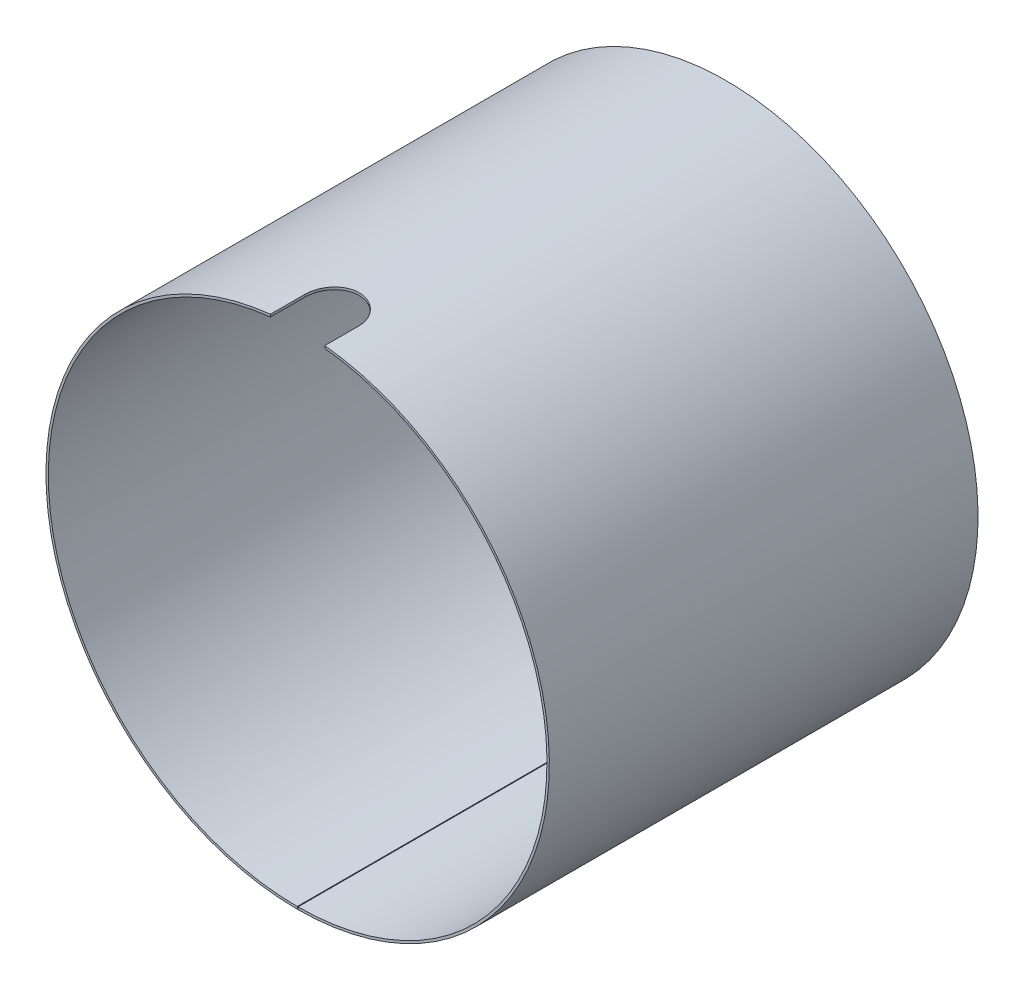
ISO-10303-21;
HEADER;
FILE_DESCRIPTION(('STEP AP214'),'2;1');
FILE_NAME('part.step','',(''),(''),'','','');
FILE_SCHEMA(('AUTOMOTIVE_DESIGN { 1 0 10303 214 1 1 1 1 }'));
ENDSEC;
DATA;
#1=APPLICATION_CONTEXT('core data for automotive mechanical design processes');
#2=APPLICATION_PROTOCOL_DEFINITION('international standard','automotive_design',2000,#1);
#3=PRODUCT_CONTEXT('',#1,'mechanical');
#4=PRODUCT('Part','Part','',(#3));
#5=PRODUCT_RELATED_PRODUCT_CATEGORY('part','',(#4));
#6=PRODUCT_DEFINITION_FORMATION('','',#4);
#7=PRODUCT_DEFINITION_CONTEXT('part definition',#1,'design');
#8=PRODUCT_DEFINITION('design','',#6,#7);
#9=PRODUCT_DEFINITION_SHAPE('','',#8);
#10=(LENGTH_UNIT() NAMED_UNIT(*) SI_UNIT(.MILLI.,.METRE.));
#11=(NAMED_UNIT(*) PLANE_ANGLE_UNIT() SI_UNIT($,.RADIAN.));
#12=(NAMED_UNIT(*) SI_UNIT($,.STERADIAN.) SOLID_ANGLE_UNIT());
#13=UNCERTAINTY_MEASURE_WITH_UNIT(LENGTH_MEASURE(1.E-05),#10,'distance_accuracy_value','');
#14=(GEOMETRIC_REPRESENTATION_CONTEXT(3) GLOBAL_UNCERTAINTY_ASSIGNED_CONTEXT((#13)) GLOBAL_UNIT_ASSIGNED_CONTEXT((#10,
#11,#12)) REPRESENTATION_CONTEXT('',''));
#15=CARTESIAN_POINT('',(0.,0.,0.));
#16=DIRECTION('',(0.,0.,1.));
#17=DIRECTION('',(1.,0.,0.));
#18=AXIS2_PLACEMENT_3D('',#15,#16,#17);
#19=CARTESIAN_POINT('',(0.,0.,6.99999997));
#20=DIRECTION('',(0.,0.,1.));
#21=DIRECTION('',(1.,0.,0.));
#22=AXIS2_PLACEMENT_3D('',#19,#20,#21);
#23=CYLINDRICAL_SURFACE('',#22,166.7748);
#24=DIRECTION('',(0.,0.,1.));
#25=VECTOR('',#24,1.);
#26=CARTESIAN_POINT('',(0.253999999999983,-166.77460657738,6.99999997));
#27=LINE('',#26,#25);
#28=CARTESIAN_POINT('',(0.253999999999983,-166.77460657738,484.425800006));
#29=VERTEX_POINT('',#28);
#30=CARTESIAN_POINT('',(0.253999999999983,-166.77460657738,200.37019997));
#31=VERTEX_POINT('',#30);
#32=EDGE_CURVE('E126',#29,#31,#27,.F.);
#33=ORIENTED_EDGE('',*,*,#32,.T.);
#34=CARTESIAN_POINT('',(0.,0.,200.37019997));
#35=DIRECTION('',(0.,0.,-1.));
#36=DIRECTION('',(-1.,0.,0.));
#37=AXIS2_PLACEMENT_3D('',#34,#35,#36);
#38=CIRCLE('',#37,166.7748);
#39=CARTESIAN_POINT('',(-0.254000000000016,-166.77460657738,200.37019997));
#40=VERTEX_POINT('',#39);
#41=EDGE_CURVE('E57',#31,#40,#38,.F.);
#42=ORIENTED_EDGE('',*,*,#41,.T.);
#43=DIRECTION('',(0.,0.,1.));
#44=VECTOR('',#43,1.);
#45=CARTESIAN_POINT('',(-0.254000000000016,-166.77460657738,6.99999997));
#46=LINE('',#45,#44);
#47=CARTESIAN_POINT('',(-0.254000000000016,-166.77460657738,484.425800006));
#48=VERTEX_POINT('',#47);
#49=EDGE_CURVE('E124',#40,#48,#46,.T.);
#50=ORIENTED_EDGE('',*,*,#49,.T.);
#51=CARTESIAN_POINT('',(0.,0.,484.425800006));
#52=DIRECTION('',(0.,0.,-1.));
#53=DIRECTION('',(-1.,0.,0.));
#54=AXIS2_PLACEMENT_3D('',#51,#52,#53);
#55=CIRCLE('',#54,166.7748);
#56=CARTESIAN_POINT('',(-17.9999999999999,165.800584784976,484.425800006));
#57=VERTEX_POINT('',#56);
#58=EDGE_CURVE('E143',#57,#48,#55,.F.);
#59=ORIENTED_EDGE('',*,*,#58,.F.);
#60=DIRECTION('',(0.,0.,1.));
#61=VECTOR('',#60,1.);
#62=CARTESIAN_POINT('',(-18.,165.800584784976,6.99999997));
#63=LINE('',#62,#61);
#64=CARTESIAN_POINT('',(-18.,165.800584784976,461.675999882));
#65=VERTEX_POINT('',#64);
#66=EDGE_CURVE('E197',#57,#65,#63,.F.);
#67=ORIENTED_EDGE('',*,*,#66,.T.);
#68=CARTESIAN_POINT('',(-17.9999999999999,165.800584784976,461.675999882));
#69=CARTESIAN_POINT('',(-18.0000003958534,165.800583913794,461.423635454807));
#70=CARTESIAN_POINT('',(-17.9946920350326,165.80116113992,461.171299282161));
#71=CARTESIAN_POINT('',(-17.9734740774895,165.803462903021,460.667086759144));
#72=CARTESIAN_POINT('',(-17.9575648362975,165.805187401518,460.415210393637));
#73=CARTESIAN_POINT('',(-17.8939713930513,165.812067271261,459.660989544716));
#74=CARTESIAN_POINT('',(-17.830421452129,165.818929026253,459.15991335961));
#75=CARTESIAN_POINT('',(-17.6615394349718,165.837001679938,458.165419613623));
#76=CARTESIAN_POINT('',(-17.5562467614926,165.84820847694,457.671995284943));
#77=CARTESIAN_POINT('',(-17.3676099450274,165.868031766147,456.940003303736));
#78=CARTESIAN_POINT('',(-17.2996110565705,165.875142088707,456.697352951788));
#79=CARTESIAN_POINT('',(-17.1534811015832,165.890317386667,456.215085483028));
#80=CARTESIAN_POINT('',(-17.0753474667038,165.898382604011,455.975469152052));
#81=CARTESIAN_POINT('',(-16.8259384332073,165.92392763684,455.261819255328));
#82=CARTESIAN_POINT('',(-16.6396562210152,165.94275669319,454.792989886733));
#83=CARTESIAN_POINT('',(-16.2284609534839,165.983473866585,453.872728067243));
#84=CARTESIAN_POINT('',(-16.003547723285,166.005361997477,453.421295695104));
#85=CARTESIAN_POINT('',(-15.6384832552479,166.040015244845,452.759646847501));
#86=CARTESIAN_POINT('',(-15.5121629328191,166.051871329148,452.541655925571));
#87=CARTESIAN_POINT('',(-15.2505358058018,166.076104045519,452.111243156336));
#88=CARTESIAN_POINT('',(-15.1152313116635,166.088480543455,451.898819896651));
#89=CARTESIAN_POINT('',(-14.6961142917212,166.126267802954,451.270341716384));
#90=CARTESIAN_POINT('',(-14.3990754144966,166.152338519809,450.863037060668));
#91=CARTESIAN_POINT('',(-13.7708228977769,166.205589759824,450.07341378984));
#92=CARTESIAN_POINT('',(-13.4394881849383,166.232773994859,449.691192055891));
#93=CARTESIAN_POINT('',(-12.7458353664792,166.287397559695,448.955973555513));
#94=CARTESIAN_POINT('',(-12.3835171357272,166.314836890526,448.602976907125));
#95=CARTESIAN_POINT('',(-11.6303901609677,166.369199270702,447.928652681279));
#96=CARTESIAN_POINT('',(-11.2395771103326,166.396122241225,447.607329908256));
#97=CARTESIAN_POINT('',(-10.4322407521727,166.448688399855,446.998673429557));
#98=CARTESIAN_POINT('',(-10.0157174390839,166.474331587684,446.711339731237));
#99=CARTESIAN_POINT('',(-9.15883581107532,166.523674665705,446.172044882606));
#100=CARTESIAN_POINT('',(-8.7184219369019,166.547369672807,445.920171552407));
#101=CARTESIAN_POINT('',(-7.81779963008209,166.592074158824,445.454439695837));
#102=CARTESIAN_POINT('',(-7.35759115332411,166.613083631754,445.240581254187));
#103=CARTESIAN_POINT('',(-6.42068349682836,166.651818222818,444.852447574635));
#104=CARTESIAN_POINT('',(-5.94398567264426,166.669543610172,444.678169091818));
#105=CARTESIAN_POINT('',(-4.97746402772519,166.701207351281,444.370449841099));
#106=CARTESIAN_POINT('',(-4.48764026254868,166.715145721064,444.237008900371));
#107=CARTESIAN_POINT('',(-3.50030622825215,166.738791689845,444.012388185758));
#108=CARTESIAN_POINT('',(-3.0028333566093,166.748515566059,443.921045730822));
#109=CARTESIAN_POINT('',(-2.00190075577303,166.76353563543,443.780531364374));
#110=CARTESIAN_POINT('',(-1.49844104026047,166.768831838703,443.731359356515));
#111=CARTESIAN_POINT('',(-0.489143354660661,166.774846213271,443.675550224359));
#112=CARTESIAN_POINT('',(0.0166946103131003,166.775564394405,443.66891300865));
#113=CARTESIAN_POINT('',(1.02712019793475,166.772402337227,443.69822256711));
#114=CARTESIAN_POINT('',(1.53170782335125,166.768522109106,443.734169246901));
#115=CARTESIAN_POINT('',(2.53391486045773,166.756299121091,443.848140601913));
#116=CARTESIAN_POINT('',(3.03155457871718,166.7479750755,443.925988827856));
#117=CARTESIAN_POINT('',(4.01847632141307,166.727110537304,444.123078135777));
#118=CARTESIAN_POINT('',(4.5077583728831,166.71457005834,444.242319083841));
#119=CARTESIAN_POINT('',(5.4745122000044,166.685624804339,444.52132607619));
#120=CARTESIAN_POINT('',(5.95198391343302,166.669220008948,444.681092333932));
#121=CARTESIAN_POINT('',(6.89175993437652,166.633006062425,445.039995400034));
#122=CARTESIAN_POINT('',(7.35406419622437,166.613196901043,445.23913232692));
#123=CARTESIAN_POINT('',(8.2612045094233,166.570684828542,445.675799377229));
#124=CARTESIAN_POINT('',(8.70600269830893,166.547976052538,445.913407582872));
#125=CARTESIAN_POINT('',(9.57401591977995,166.500333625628,446.425031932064));
#126=CARTESIAN_POINT('',(9.99723092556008,166.475399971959,446.699048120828));
#127=CARTESIAN_POINT('',(10.8191266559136,166.42400663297,447.281549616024));
#128=CARTESIAN_POINT('',(11.2178077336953,166.397546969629,447.590034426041));
#129=CARTESIAN_POINT('',(11.9878722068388,166.34384221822,448.239312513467));
#130=CARTESIAN_POINT('',(12.3592555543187,166.316597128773,448.580105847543));
#131=CARTESIAN_POINT('',(13.0739197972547,166.261948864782,449.293401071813));
#132=CARTESIAN_POINT('',(13.4170518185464,166.234545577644,449.666052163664));
#133=CARTESIAN_POINT('',(14.0707187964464,166.180493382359,450.438959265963));
#134=CARTESIAN_POINT('',(14.3812533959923,166.153844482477,450.839215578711));
#135=CARTESIAN_POINT('',(14.9676566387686,166.102046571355,451.664727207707));
#136=CARTESIAN_POINT('',(15.2435143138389,166.076898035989,452.089990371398));
#137=CARTESIAN_POINT('',(15.6296355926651,166.040853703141,452.74410991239));
#138=CARTESIAN_POINT('',(15.7537352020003,166.029118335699,452.964860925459));
#139=CARTESIAN_POINT('',(15.9925589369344,166.006284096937,453.411485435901));
#140=CARTESIAN_POINT('',(16.1072806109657,165.995185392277,453.637360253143));
#141=CARTESIAN_POINT('',(16.4371571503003,165.962955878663,454.322310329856));
#142=CARTESIAN_POINT('',(16.6378864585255,165.942904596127,454.788478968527));
#143=CARTESIAN_POINT('',(16.9992997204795,165.906271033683,455.736217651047));
#144=CARTESIAN_POINT('',(17.1599840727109,165.889688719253,456.217787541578));
#145=CARTESIAN_POINT('',(17.3700048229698,165.867783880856,456.948722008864));
#146=CARTESIAN_POINT('',(17.4348213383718,165.860979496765,457.19368174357));
#147=CARTESIAN_POINT('',(17.5540505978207,165.848403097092,457.68607860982));
#148=CARTESIAN_POINT('',(17.6084658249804,165.842630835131,457.933515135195));
#149=CARTESIAN_POINT('',(17.7559298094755,165.826930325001,458.678796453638));
#150=CARTESIAN_POINT('',(17.833279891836,165.81860961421,459.179902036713));
#151=CARTESIAN_POINT('',(17.9262355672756,165.808580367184,460.014332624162));
#152=CARTESIAN_POINT('',(17.953913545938,165.805583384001,460.34636872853));
#153=CARTESIAN_POINT('',(17.9907818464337,165.801585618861,461.010919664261));
#154=CARTESIAN_POINT('',(18.0000030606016,165.800581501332,461.343432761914));
#155=CARTESIAN_POINT('',(18.0000000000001,165.800584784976,461.675999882));
#156=B_SPLINE_CURVE_WITH_KNOTS('',3,(#68,#69,#70,#71,#72,#73,#74,#75,#76,#77,#78,#79,#80,#81,
#82,#83,#84,#85,#86,#87,#88,#89,#90,#91,#92,#93,#94,#95,#96,#97,#98,#99,#100,#101,#102,#103,
#104,#105,#106,#107,#108,#109,#110,#111,#112,#113,#114,#115,#116,#117,#118,#119,#120,#121,#122,
#123,#124,#125,#126,#127,#128,#129,#130,#131,#132,#133,#134,#135,#136,#137,#138,#139,#140,#141,
#142,#143,#144,#145,#146,#147,#148,#149,#150,#151,#152,#153,#154,#155),.UNSPECIFIED.,.F.,.F.,(4,
2,2,2,2,2,2,2,2,2,2,2,2,2,2,2,2,2,2,2,2,2,2,2,2,2,2,2,2,2,2,2,2,2,2,2,2,2,2,2,2,2,2,4),(0.,
0.756980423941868,1.5139354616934,3.02742706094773,4.539493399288,5.29559276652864,
6.05188412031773,7.56448258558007,9.0770878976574,9.83356754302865,10.5898533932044,
12.1022837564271,13.6202483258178,15.1382190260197,16.6564196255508,18.1746205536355,
19.6965176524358,21.2184181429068,22.7401938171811,24.2619630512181,25.7778013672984,
27.2936362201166,28.8094678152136,30.3252960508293,31.8347904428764,33.344279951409,
34.8537774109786,36.363279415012,37.8758844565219,39.3884913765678,40.9010765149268,
42.4136643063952,43.9337711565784,45.4538946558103,46.9744977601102,47.7348460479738,
48.4953924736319,50.0172926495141,51.5391776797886,52.2994188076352,53.0594782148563,
54.5786972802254,55.5778356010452,56.5753001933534),.UNSPECIFIED.);
#157=CARTESIAN_POINT('',(18.0000000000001,165.800584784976,461.675999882));
#158=VERTEX_POINT('',#157);
#159=EDGE_CURVE('E199',#65,#158,#156,.T.);
#160=ORIENTED_EDGE('',*,*,#159,.T.);
#161=DIRECTION('',(0.,0.,1.));
#162=VECTOR('',#161,1.);
#163=CARTESIAN_POINT('',(18.,165.800584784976,6.99999997));
#164=LINE('',#163,#162);
#165=CARTESIAN_POINT('',(18.,165.800584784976,484.425800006));
#166=VERTEX_POINT('',#165);
#167=EDGE_CURVE('E196',#158,#166,#164,.T.);
#168=ORIENTED_EDGE('',*,*,#167,.T.);
#169=EDGE_CURVE('E139',#29,#166,#55,.F.);
#170=ORIENTED_EDGE('',*,*,#169,.F.);
#171=EDGE_LOOP('',(#33,#42,#50,#59,#67,#160,#168,#170));
#172=FACE_BOUND('',#171,.T.);
#173=ADVANCED_FACE('F43',(#172),#23,.T.);
#174=CARTESIAN_POINT('',(0.,0.,-467.256161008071));
#175=DIRECTION('',(0.,0.,1.));
#176=DIRECTION('',(1.,0.,0.));
#177=AXIS2_PLACEMENT_3D('',#174,#175,#176);
#178=CYLINDRICAL_SURFACE('',#177,165.2);
#179=DIRECTION('',(0.,0.,1.));
#180=VECTOR('',#179,1.);
#181=CARTESIAN_POINT('',(-0.254000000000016,-165.199804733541,-467.256161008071));
#182=LINE('',#181,#180);
#183=CARTESIAN_POINT('',(-0.254000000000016,-165.199804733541,484.425800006));
#184=VERTEX_POINT('',#183);
#185=CARTESIAN_POINT('',(-0.254000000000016,-165.199804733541,200.37019997));
#186=VERTEX_POINT('',#185);
#187=EDGE_CURVE('E118',#184,#186,#182,.F.);
#188=ORIENTED_EDGE('',*,*,#187,.T.);
#189=CARTESIAN_POINT('',(0.,0.,200.37019997));
#190=DIRECTION('',(0.,0.,-1.));
#191=DIRECTION('',(-1.,0.,0.));
#192=AXIS2_PLACEMENT_3D('',#189,#190,#191);
#193=CIRCLE('',#192,165.2);
#194=CARTESIAN_POINT('',(0.253999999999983,-165.199804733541,200.37019997));
#195=VERTEX_POINT('',#194);
#196=EDGE_CURVE('E107',#186,#195,#193,.T.);
#197=ORIENTED_EDGE('',*,*,#196,.T.);
#198=DIRECTION('',(0.,0.,1.));
#199=VECTOR('',#198,1.);
#200=CARTESIAN_POINT('',(0.253999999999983,-165.199804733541,-467.256161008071));
#201=LINE('',#200,#199);
#202=CARTESIAN_POINT('',(0.253999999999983,-165.199804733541,484.425800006));
#203=VERTEX_POINT('',#202);
#204=EDGE_CURVE('E115',#195,#203,#201,.T.);
#205=ORIENTED_EDGE('',*,*,#204,.T.);
#206=CARTESIAN_POINT('',(0.,0.,484.425800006));
#207=DIRECTION('',(0.,0.,-1.));
#208=DIRECTION('',(-1.,0.,0.));
#209=AXIS2_PLACEMENT_3D('',#206,#207,#208);
#210=CIRCLE('',#209,165.2);
#211=CARTESIAN_POINT('',(18.0000000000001,164.216442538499,484.425800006));
#212=VERTEX_POINT('',#211);
#213=EDGE_CURVE('E146',#212,#203,#210,.T.);
#214=ORIENTED_EDGE('',*,*,#213,.F.);
#215=DIRECTION('',(0.,0.,1.));
#216=VECTOR('',#215,1.);
#217=CARTESIAN_POINT('',(17.9999999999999,164.216442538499,-467.256161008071));
#218=LINE('',#217,#216);
#219=CARTESIAN_POINT('',(18.0000000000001,164.216442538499,461.675999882));
#220=VERTEX_POINT('',#219);
#221=EDGE_CURVE('E154',#220,#212,#218,.T.);
#222=ORIENTED_EDGE('',*,*,#221,.F.);
#223=CARTESIAN_POINT('',(-17.9999999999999,164.216442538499,461.675999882));
#224=CARTESIAN_POINT('',(-18.0000003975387,164.216441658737,461.423650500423));
#225=CARTESIAN_POINT('',(-17.9946926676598,164.217024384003,461.171329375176));
#226=CARTESIAN_POINT('',(-17.9734772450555,164.219348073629,460.667146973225));
#227=CARTESIAN_POINT('',(-17.9575699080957,164.221088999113,460.415285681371));
#228=CARTESIAN_POINT('',(-17.8939841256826,164.228034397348,459.661110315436));
#229=CARTESIAN_POINT('',(-17.8304418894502,164.234961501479,459.160064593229));
#230=CARTESIAN_POINT('',(-17.661581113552,164.253206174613,458.165634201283));
#231=CARTESIAN_POINT('',(-17.556302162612,164.26451958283,457.672242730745));
#232=CARTESIAN_POINT('',(-17.3676905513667,164.28453136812,456.940299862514));
#233=CARTESIAN_POINT('',(-17.2997008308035,164.291709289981,456.697665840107));
#234=CARTESIAN_POINT('',(-17.1535908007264,164.307028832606,456.215430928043));
#235=CARTESIAN_POINT('',(-17.075467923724,164.315170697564,455.975830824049));
#236=CARTESIAN_POINT('',(-16.8260939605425,164.340958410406,455.262230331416));
#237=CARTESIAN_POINT('',(-16.6398385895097,164.359966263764,454.793433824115));
#238=CARTESIAN_POINT('',(-16.2287038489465,164.401069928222,453.873235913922));
#239=CARTESIAN_POINT('',(-16.0038243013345,164.42316575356,453.421834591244));
#240=CARTESIAN_POINT('',(-15.6388152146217,164.458147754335,452.760229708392));
#241=CARTESIAN_POINT('',(-15.5125140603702,164.47011631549,452.542252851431));
#242=CARTESIAN_POINT('',(-15.2509268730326,164.494578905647,452.111867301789));
#243=CARTESIAN_POINT('',(-15.1156431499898,164.50707279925,451.899457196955));
#244=CARTESIAN_POINT('',(-14.696590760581,164.545218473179,451.271016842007));
#245=CARTESIAN_POINT('',(-14.3995980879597,164.571536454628,450.863735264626));
#246=CARTESIAN_POINT('',(-13.771421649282,164.625294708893,450.07412496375));
#247=CARTESIAN_POINT('',(-13.4401145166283,164.652738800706,449.691894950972));
#248=CARTESIAN_POINT('',(-12.7465169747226,164.707884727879,448.956657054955));
#249=CARTESIAN_POINT('',(-12.3842264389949,164.73558656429,448.603649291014));
#250=CARTESIAN_POINT('',(-11.6311540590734,164.79046930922,447.929299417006));
#251=CARTESIAN_POINT('',(-11.2403679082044,164.817650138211,447.607962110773));
#252=CARTESIAN_POINT('',(-10.4330835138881,164.870720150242,446.999272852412));
#253=CARTESIAN_POINT('',(-10.0165852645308,164.896609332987,446.711920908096));
#254=CARTESIAN_POINT('',(-9.15973036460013,164.946427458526,446.172572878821));
#255=CARTESIAN_POINT('',(-8.71931704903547,164.970351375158,445.920666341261));
#256=CARTESIAN_POINT('',(-7.81869034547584,165.015488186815,445.454868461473));
#257=CARTESIAN_POINT('',(-7.35847691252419,165.036701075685,445.240977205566));
#258=CARTESIAN_POINT('',(-6.42155389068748,165.075811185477,444.852779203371));
#259=CARTESIAN_POINT('',(-5.94484566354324,165.093708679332,444.678469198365));
#260=CARTESIAN_POINT('',(-4.9782978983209,165.125680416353,444.370689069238));
#261=CARTESIAN_POINT('',(-4.48845841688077,165.139754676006,444.237218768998));
#262=CARTESIAN_POINT('',(-3.50112518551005,165.163630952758,444.012550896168));
#263=CARTESIAN_POINT('',(-3.00366956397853,165.173449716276,443.921187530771));
#264=CARTESIAN_POINT('',(-2.00276846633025,165.188617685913,443.780628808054));
#265=CARTESIAN_POINT('',(-1.49932300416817,165.193966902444,443.731433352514));
#266=CARTESIAN_POINT('',(-0.490051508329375,165.200043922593,443.675575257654));
#267=CARTESIAN_POINT('',(0.0157745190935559,165.200771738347,443.668912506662));
#268=CARTESIAN_POINT('',(1.02617822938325,165.197585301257,443.698169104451));
#269=CARTESIAN_POINT('',(1.53075591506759,165.193671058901,443.734088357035));
#270=CARTESIAN_POINT('',(2.53290451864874,165.181338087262,443.847998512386));
#271=CARTESIAN_POINT('',(3.03049612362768,165.172938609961,443.925809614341));
#272=CARTESIAN_POINT('',(4.01732435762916,165.151883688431,444.122815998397));
#273=CARTESIAN_POINT('',(4.50656101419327,165.139228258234,444.242011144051));
#274=CARTESIAN_POINT('',(5.47322758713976,165.110016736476,444.520917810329));
#275=CARTESIAN_POINT('',(5.95065743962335,165.093460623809,444.680629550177));
#276=CARTESIAN_POINT('',(6.89035423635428,165.056911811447,445.039414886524));
#277=CARTESIAN_POINT('',(7.35262113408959,165.03691910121,445.238488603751));
#278=CARTESIAN_POINT('',(8.25970928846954,164.994011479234,445.675028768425));
#279=CARTESIAN_POINT('',(8.70449200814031,164.971090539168,445.912574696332));
#280=CARTESIAN_POINT('',(9.57247984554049,164.923002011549,446.424069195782));
#281=CARTESIAN_POINT('',(9.99568493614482,164.897834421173,446.698017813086));
#282=CARTESIAN_POINT('',(10.8175679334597,164.845957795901,447.280379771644));
#283=CARTESIAN_POINT('',(11.2162461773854,164.819248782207,447.58879263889));
#284=CARTESIAN_POINT('',(11.9863130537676,164.765036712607,448.237923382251));
#285=CARTESIAN_POINT('',(12.3577016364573,164.737533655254,448.578641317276));
#286=CARTESIAN_POINT('',(13.0724204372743,164.68236388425,449.291818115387));
#287=CARTESIAN_POINT('',(13.4155988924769,164.654697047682,449.664429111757));
#288=CARTESIAN_POINT('',(14.0693622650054,164.600123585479,450.437260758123));
#289=CARTESIAN_POINT('',(14.3799468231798,164.573216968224,450.837481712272));
#290=CARTESIAN_POINT('',(14.966453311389,164.520916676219,451.662928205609));
#291=CARTESIAN_POINT('',(15.2423642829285,164.495523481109,452.088161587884));
#292=CARTESIAN_POINT('',(15.628567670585,164.45912736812,452.742241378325));
#293=CARTESIAN_POINT('',(15.7526950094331,164.447277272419,452.9629799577));
#294=CARTESIAN_POINT('',(15.9915748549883,164.424219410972,453.409581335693));
#295=CARTESIAN_POINT('',(16.1063249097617,164.413011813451,453.635445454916));
#296=CARTESIAN_POINT('',(16.4362891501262,164.380465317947,454.320369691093));
#297=CARTESIAN_POINT('',(16.637078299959,164.360215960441,454.786526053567));
#298=CARTESIAN_POINT('',(16.9986117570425,164.323218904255,455.734247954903));
#299=CARTESIAN_POINT('',(17.1593564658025,164.306471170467,456.215813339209));
#300=CARTESIAN_POINT('',(17.3694672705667,164.284346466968,456.946746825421));
#301=CARTESIAN_POINT('',(17.434313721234,164.277473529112,457.191707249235));
#302=CARTESIAN_POINT('',(17.5536025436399,164.264769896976,457.684107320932));
#303=CARTESIAN_POINT('',(17.6080473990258,164.258938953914,457.931546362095));
#304=CARTESIAN_POINT('',(17.7555996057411,164.243077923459,458.6768378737));
#305=CARTESIAN_POINT('',(17.8330076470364,164.234670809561,459.177953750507));
#306=CARTESIAN_POINT('',(17.9260916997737,164.224530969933,460.012716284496));
#307=CARTESIAN_POINT('',(17.9538236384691,164.22149919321,460.345074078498));
#308=CARTESIAN_POINT('',(17.9907638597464,164.217454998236,461.010271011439));
#309=CARTESIAN_POINT('',(18.0000031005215,164.216439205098,461.343108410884));
#310=CARTESIAN_POINT('',(18.0000000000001,164.216442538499,461.675999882));
#311=B_SPLINE_CURVE_WITH_KNOTS('',3,(#223,#224,#225,#226,#227,#228,#229,#230,#231,#232,#233,
#234,#235,#236,#237,#238,#239,#240,#241,#242,#243,#244,#245,#246,#247,#248,#249,#250,#251,#252,
#253,#254,#255,#256,#257,#258,#259,#260,#261,#262,#263,#264,#265,#266,#267,#268,#269,#270,#271,
#272,#273,#274,#275,#276,#277,#278,#279,#280,#281,#282,#283,#284,#285,#286,#287,#288,#289,#290,
#291,#292,#293,#294,#295,#296,#297,#298,#299,#300,#301,#302,#303,#304,#305,#306,#307,#308,#309,
#310),.UNSPECIFIED.,.F.,.F.,(4,2,2,2,2,2,2,2,2,2,2,2,2,2,2,2,2,2,2,2,2,2,2,2,2,2,2,2,2,2,2,2,2,
2,2,2,2,2,2,2,2,2,2,4),(0.,0.756935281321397,1.5138451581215,3.02724581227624,4.53921437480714,
5.29526493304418,6.05150743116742,7.56400497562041,9.07650949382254,9.83293985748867,
10.5891764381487,12.1015084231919,13.6194797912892,15.1374573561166,16.655664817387,
18.1738726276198,19.6958496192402,21.2178300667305,22.7396851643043,24.2615336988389,
25.7773377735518,27.2931383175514,28.8089348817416,30.3247280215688,31.8340666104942,
33.3434002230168,34.8527420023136,36.3620884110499,37.874593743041,39.3871009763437,
40.8995874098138,42.4120766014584,43.9322322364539,45.4524046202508,46.9730562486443,
47.733428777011,48.4939994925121,50.0159600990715,51.537905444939,52.2981770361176,
53.058266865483,54.5775468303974,55.577659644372,56.5760967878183),.UNSPECIFIED.);
#312=CARTESIAN_POINT('',(-17.9999999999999,164.216442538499,461.675999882));
#313=VERTEX_POINT('',#312);
#314=EDGE_CURVE('E65',#313,#220,#311,.T.);
#315=ORIENTED_EDGE('',*,*,#314,.F.);
#316=DIRECTION('',(0.,0.,1.));
#317=VECTOR('',#316,1.);
#318=CARTESIAN_POINT('',(-18.0000000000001,164.216442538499,-467.256161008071));
#319=LINE('',#318,#317);
#320=CARTESIAN_POINT('',(-18.,164.216442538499,484.425800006));
#321=VERTEX_POINT('',#320);
#322=EDGE_CURVE('E51',#321,#313,#319,.F.);
#323=ORIENTED_EDGE('',*,*,#322,.F.);
#324=EDGE_CURVE('E142',#184,#321,#210,.T.);
#325=ORIENTED_EDGE('',*,*,#324,.F.);
#326=EDGE_LOOP('',(#188,#197,#205,#214,#222,#315,#323,#325));
#327=FACE_BOUND('',#326,.T.);
#328=ADVANCED_FACE('F113',(#327),#178,.F.);
#329=CARTESIAN_POINT('',(-0.254000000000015,-160.146131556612,484.426800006));
#330=DIRECTION('',(-1.,0.,0.));
#331=DIRECTION('',(0.,-1.,0.));
#332=AXIS2_PLACEMENT_3D('',#329,#330,#331);
#333=PLANE('',#332);
#334=DIRECTION('',(0.,-1.,0.));
#335=VECTOR('',#334,1.);
#336=CARTESIAN_POINT('',(-0.254000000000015,-160.146131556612,200.37019997));
#337=LINE('',#336,#335);
#338=EDGE_CURVE('E128',#186,#40,#337,.T.);
#339=ORIENTED_EDGE('',*,*,#338,.F.);
#340=ORIENTED_EDGE('',*,*,#187,.F.);
#341=DIRECTION('',(0.,-1.,0.));
#342=VECTOR('',#341,1.);
#343=CARTESIAN_POINT('',(-0.254000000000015,-160.146131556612,484.425800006));
#344=LINE('',#343,#342);
#345=EDGE_CURVE('E134',#184,#48,#344,.T.);
#346=ORIENTED_EDGE('',*,*,#345,.T.);
#347=ORIENTED_EDGE('',*,*,#49,.F.);
#348=EDGE_LOOP('',(#339,#340,#346,#347));
#349=FACE_BOUND('',#348,.T.);
#350=ADVANCED_FACE('F162',(#349),#333,.F.);
#351=CARTESIAN_POINT('',(0.253999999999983,-160.146131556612,484.426800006));
#352=DIRECTION('',(1.,0.,0.));
#353=DIRECTION('',(0.,1.,0.));
#354=AXIS2_PLACEMENT_3D('',#351,#352,#353);
#355=PLANE('',#354);
#356=DIRECTION('',(0.,1.,0.));
#357=VECTOR('',#356,1.);
#358=CARTESIAN_POINT('',(0.253999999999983,-160.146131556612,200.37019997));
#359=LINE('',#358,#357);
#360=EDGE_CURVE('E13',#31,#195,#359,.T.);
#361=ORIENTED_EDGE('',*,*,#360,.F.);
#362=ORIENTED_EDGE('',*,*,#32,.F.);
#363=DIRECTION('',(0.,1.,0.));
#364=VECTOR('',#363,1.);
#365=CARTESIAN_POINT('',(0.253999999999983,-160.146131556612,484.425800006));
#366=LINE('',#365,#364);
#367=EDGE_CURVE('E122',#29,#203,#366,.T.);
#368=ORIENTED_EDGE('',*,*,#367,.T.);
#369=ORIENTED_EDGE('',*,*,#204,.F.);
#370=EDGE_LOOP('',(#361,#362,#368,#369));
#371=FACE_BOUND('',#370,.T.);
#372=ADVANCED_FACE('F120',(#371),#355,.F.);
#373=CARTESIAN_POINT('',(32.3093469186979,-30.6623079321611,484.425800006));
#374=DIRECTION('',(0.,0.,-1.));
#375=DIRECTION('',(-1.,0.,0.));
#376=AXIS2_PLACEMENT_3D('',#373,#374,#375);
#377=PLANE('',#376);
#378=ORIENTED_EDGE('',*,*,#213,.T.);
#379=ORIENTED_EDGE('',*,*,#367,.F.);
#380=ORIENTED_EDGE('',*,*,#169,.T.);
#381=DIRECTION('',(0.,-1.,0.));
#382=VECTOR('',#381,1.);
#383=CARTESIAN_POINT('',(18.0000000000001,200.,484.425800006));
#384=LINE('',#383,#382);
#385=EDGE_CURVE('E140',#166,#212,#384,.T.);
#386=ORIENTED_EDGE('',*,*,#385,.T.);
#387=EDGE_LOOP('',(#378,#379,#380,#386));
#388=FACE_BOUND('',#387,.T.);
#389=ADVANCED_FACE('F173',(#388),#377,.F.);
#390=CARTESIAN_POINT('',(18.0000000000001,200.,511.675999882));
#391=DIRECTION('',(-1.,0.,0.));
#392=DIRECTION('',(0.,0.,1.));
#393=AXIS2_PLACEMENT_3D('',#390,#391,#392);
#394=PLANE('',#393);
#395=ORIENTED_EDGE('',*,*,#385,.F.);
#396=ORIENTED_EDGE('',*,*,#167,.F.);
#397=DIRECTION('',(0.,-1.,0.));
#398=VECTOR('',#397,1.);
#399=CARTESIAN_POINT('',(18.0000000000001,200.,461.675999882));
#400=LINE('',#399,#398);
#401=EDGE_CURVE('E193',#158,#220,#400,.T.);
#402=ORIENTED_EDGE('',*,*,#401,.T.);
#403=ORIENTED_EDGE('',*,*,#221,.T.);
#404=EDGE_LOOP('',(#395,#396,#402,#403));
#405=FACE_BOUND('',#404,.T.);
#406=ADVANCED_FACE('F174',(#405),#394,.T.);
#407=CARTESIAN_POINT('',(0.,200.,461.675999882));
#408=DIRECTION('',(0.,-1.,0.));
#409=DIRECTION('',(0.,0.,-1.));
#410=AXIS2_PLACEMENT_3D('',#407,#408,#409);
#411=CYLINDRICAL_SURFACE('',#410,18.);
#412=DIRECTION('',(0.,-1.,0.));
#413=VECTOR('',#412,1.);
#414=CARTESIAN_POINT('',(-17.9999999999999,200.,461.675999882));
#415=LINE('',#414,#413);
#416=EDGE_CURVE('E189',#65,#313,#415,.T.);
#417=ORIENTED_EDGE('',*,*,#416,.T.);
#418=ORIENTED_EDGE('',*,*,#314,.T.);
#419=ORIENTED_EDGE('',*,*,#401,.F.);
#420=ORIENTED_EDGE('',*,*,#159,.F.);
#421=EDGE_LOOP('',(#417,#418,#419,#420));
#422=FACE_BOUND('',#421,.T.);
#423=ADVANCED_FACE('F156',(#422),#411,.F.);
#424=CARTESIAN_POINT('',(-17.9999999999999,200.,511.675999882));
#425=DIRECTION('',(1.,0.,0.));
#426=DIRECTION('',(0.,0.,-1.));
#427=AXIS2_PLACEMENT_3D('',#424,#425,#426);
#428=PLANE('',#427);
#429=DIRECTION('',(0.,1.,0.));
#430=VECTOR('',#429,1.);
#431=CARTESIAN_POINT('',(-17.9999999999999,200.,484.425800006));
#432=LINE('',#431,#430);
#433=EDGE_CURVE('E137',#321,#57,#432,.T.);
#434=ORIENTED_EDGE('',*,*,#433,.F.);
#435=ORIENTED_EDGE('',*,*,#322,.T.);
#436=ORIENTED_EDGE('',*,*,#416,.F.);
#437=ORIENTED_EDGE('',*,*,#66,.F.);
#438=EDGE_LOOP('',(#434,#435,#436,#437));
#439=FACE_BOUND('',#438,.T.);
#440=ADVANCED_FACE('F165',(#439),#428,.T.);
#441=ORIENTED_EDGE('',*,*,#58,.T.);
#442=ORIENTED_EDGE('',*,*,#345,.F.);
#443=ORIENTED_EDGE('',*,*,#324,.T.);
#444=ORIENTED_EDGE('',*,*,#433,.T.);
#445=EDGE_LOOP('',(#441,#442,#443,#444));
#446=FACE_BOUND('',#445,.T.);
#447=ADVANCED_FACE('F163',(#446),#377,.F.);
#448=CARTESIAN_POINT('',(0.,0.,200.37019997));
#449=DIRECTION('',(0.,0.,-1.));
#450=DIRECTION('',(-1.,0.,0.));
#451=AXIS2_PLACEMENT_3D('',#448,#449,#450);
#452=PLANE('',#451);
#453=ORIENTED_EDGE('',*,*,#338,.T.);
#454=ORIENTED_EDGE('',*,*,#41,.F.);
#455=ORIENTED_EDGE('',*,*,#360,.T.);
#456=ORIENTED_EDGE('',*,*,#196,.F.);
#457=EDGE_LOOP('',(#453,#454,#455,#456));
#458=FACE_BOUND('',#457,.T.);
#459=ADVANCED_FACE('F106',(#458),#452,.T.);
#460=CLOSED_SHELL('',(#173,#328,#350,#372,#389,#406,#423,#440,#447,#459));
#461=MANIFOLD_SOLID_BREP('B2',#460);
#462=ADVANCED_BREP_SHAPE_REPRESENTATION('',(#18,#461),#14);
#463=SHAPE_DEFINITION_REPRESENTATION(#9,#462);
ENDSEC;
END-ISO-10303-21;
